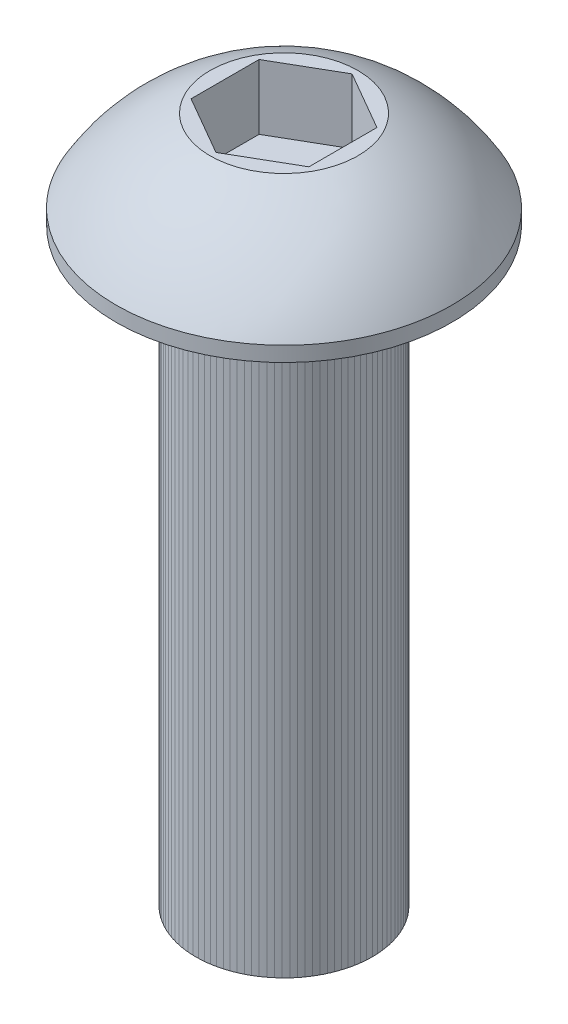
ISO-10303-21;
HEADER;
FILE_DESCRIPTION(('STEP AP214'),'2;1');
FILE_NAME('part.step','',(''),(''),'','','');
FILE_SCHEMA(('AUTOMOTIVE_DESIGN { 1 0 10303 214 1 1 1 1 }'));
ENDSEC;
DATA;
#1=APPLICATION_CONTEXT('core data for automotive mechanical design processes');
#2=APPLICATION_PROTOCOL_DEFINITION('international standard','automotive_design',2000,#1);
#3=PRODUCT_CONTEXT('',#1,'mechanical');
#4=PRODUCT('Part','Part','',(#3));
#5=PRODUCT_RELATED_PRODUCT_CATEGORY('part','',(#4));
#6=PRODUCT_DEFINITION_FORMATION('','',#4);
#7=PRODUCT_DEFINITION_CONTEXT('part definition',#1,'design');
#8=PRODUCT_DEFINITION('design','',#6,#7);
#9=PRODUCT_DEFINITION_SHAPE('','',#8);
#10=(LENGTH_UNIT() NAMED_UNIT(*) SI_UNIT(.MILLI.,.METRE.));
#11=(NAMED_UNIT(*) PLANE_ANGLE_UNIT() SI_UNIT($,.RADIAN.));
#12=(NAMED_UNIT(*) SI_UNIT($,.STERADIAN.) SOLID_ANGLE_UNIT());
#13=UNCERTAINTY_MEASURE_WITH_UNIT(LENGTH_MEASURE(1.E-05),#10,'distance_accuracy_value','');
#14=(GEOMETRIC_REPRESENTATION_CONTEXT(3) GLOBAL_UNCERTAINTY_ASSIGNED_CONTEXT((#13)) GLOBAL_UNIT_ASSIGNED_CONTEXT((#10,
#11,#12)) REPRESENTATION_CONTEXT('',''));
#15=CARTESIAN_POINT('',(0.,0.,0.));
#16=DIRECTION('',(0.,0.,1.));
#17=DIRECTION('',(1.,0.,0.));
#18=AXIS2_PLACEMENT_3D('',#15,#16,#17);
#19=CARTESIAN_POINT('',(0.,-10.,0.));
#20=DIRECTION('',(0.,1.,0.));
#21=DIRECTION('',(0.,0.,1.));
#22=AXIS2_PLACEMENT_3D('',#19,#20,#21);
#23=CYLINDRICAL_SURFACE('',#22,1.5);
#24=CARTESIAN_POINT('',(0.,0.,0.));
#25=DIRECTION('',(0.,1.,0.));
#26=DIRECTION('',(0.,0.,1.));
#27=AXIS2_PLACEMENT_3D('',#24,#25,#26);
#28=CIRCLE('',#27,1.5);
#29=CARTESIAN_POINT('',(0.,0.,1.5));
#30=VERTEX_POINT('',#29);
#31=EDGE_CURVE('P0_E16',#30,#30,#28,.F.);
#32=ORIENTED_EDGE('',*,*,#31,.T.);
#33=EDGE_LOOP('',(#32));
#34=FACE_BOUND('',#33,.T.);
#35=CARTESIAN_POINT('',(0.,-10.,0.));
#36=DIRECTION('',(0.,1.,0.));
#37=DIRECTION('',(0.,0.,1.));
#38=AXIS2_PLACEMENT_3D('',#35,#36,#37);
#39=CIRCLE('',#38,1.5);
#40=CARTESIAN_POINT('',(0.,-10.,1.5));
#41=VERTEX_POINT('',#40);
#42=EDGE_CURVE('P0_E10',#41,#41,#39,.T.);
#43=ORIENTED_EDGE('',*,*,#42,.T.);
#44=EDGE_LOOP('',(#43));
#45=FACE_BOUND('',#44,.T.);
#46=ADVANCED_FACE('P0_F15',(#34,#45),#23,.T.);
#47=OPEN_SHELL('',(#46));
#48=SHELL_BASED_SURFACE_MODEL('P0_B1',(#47));
#49=CARTESIAN_POINT('',(0.,0.55,0.));
#50=DIRECTION('',(0.,1.,0.));
#51=DIRECTION('',(0.,0.,1.));
#52=AXIS2_PLACEMENT_3D('',#49,#50,#51);
#53=PLANE('',#52);
#54=DIRECTION('',(0.866025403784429,0.,0.500000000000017));
#55=VECTOR('',#54,1.);
#56=CARTESIAN_POINT('',(-1.,0.55,0.5773502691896));
#57=LINE('',#56,#55);
#58=CARTESIAN_POINT('',(-1.,0.55,0.5773502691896));
#59=VERTEX_POINT('',#58);
#60=CARTESIAN_POINT('',(0.,0.55,1.15470053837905));
#61=VERTEX_POINT('',#60);
#62=EDGE_CURVE('P1_E92',#59,#61,#57,.T.);
#63=ORIENTED_EDGE('',*,*,#62,.T.);
#64=DIRECTION('',(0.866025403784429,0.,-0.500000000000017));
#65=VECTOR('',#64,1.);
#66=CARTESIAN_POINT('',(0.,0.55,1.154700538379));
#67=LINE('',#66,#65);
#68=CARTESIAN_POINT('',(0.999999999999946,0.55,0.577350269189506));
#69=VERTEX_POINT('',#68);
#70=EDGE_CURVE('P1_E89',#61,#69,#67,.T.);
#71=ORIENTED_EDGE('',*,*,#70,.T.);
#72=DIRECTION('',(0.,0.,-1.));
#73=VECTOR('',#72,1.);
#74=CARTESIAN_POINT('',(1.,0.55,0.5773502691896));
#75=LINE('',#74,#73);
#76=CARTESIAN_POINT('',(1.,0.55,-0.5773502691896));
#77=VERTEX_POINT('',#76);
#78=EDGE_CURVE('P1_E85',#69,#77,#75,.T.);
#79=ORIENTED_EDGE('',*,*,#78,.T.);
#80=DIRECTION('',(-0.866025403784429,0.,-0.500000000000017));
#81=VECTOR('',#80,1.);
#82=CARTESIAN_POINT('',(1.,0.55,-0.5773502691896));
#83=LINE('',#82,#81);
#84=CARTESIAN_POINT('',(0.,0.55,-1.15470053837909));
#85=VERTEX_POINT('',#84);
#86=EDGE_CURVE('P1_E115',#77,#85,#83,.T.);
#87=ORIENTED_EDGE('',*,*,#86,.T.);
#88=DIRECTION('',(-0.866025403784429,0.,0.500000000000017));
#89=VECTOR('',#88,1.);
#90=CARTESIAN_POINT('',(0.,0.55,-1.154700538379));
#91=LINE('',#90,#89);
#92=CARTESIAN_POINT('',(-0.999999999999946,0.55,-0.577350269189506));
#93=VERTEX_POINT('',#92);
#94=EDGE_CURVE('P1_E171',#85,#93,#91,.T.);
#95=ORIENTED_EDGE('',*,*,#94,.T.);
#96=DIRECTION('',(0.,0.,1.));
#97=VECTOR('',#96,1.);
#98=CARTESIAN_POINT('',(-1.,0.55,-0.5773502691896));
#99=LINE('',#98,#97);
#100=EDGE_CURVE('P1_E165',#93,#59,#99,.T.);
#101=ORIENTED_EDGE('',*,*,#100,.T.);
#102=EDGE_LOOP('',(#63,#71,#79,#87,#95,#101));
#103=FACE_BOUND('',#102,.T.);
#104=ADVANCED_FACE('P1_F17',(#103),#53,.T.);
#105=CARTESIAN_POINT('',(0.,1.65,1.154700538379));
#106=DIRECTION('',(0.500000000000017,0.,0.866025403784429));
#107=DIRECTION('',(0.866025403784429,0.,-0.500000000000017));
#108=AXIS2_PLACEMENT_3D('',#105,#106,#107);
#109=PLANE('',#108);
#110=ORIENTED_EDGE('',*,*,#70,.F.);
#111=DIRECTION('',(0.,1.,0.));
#112=VECTOR('',#111,1.);
#113=CARTESIAN_POINT('',(-1.08637057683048E-13,1.65,1.15470053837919));
#114=LINE('',#113,#112);
#115=CARTESIAN_POINT('',(0.,1.65,1.15470053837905));
#116=VERTEX_POINT('',#115);
#117=EDGE_CURVE('P1_E158',#61,#116,#114,.T.);
#118=ORIENTED_EDGE('',*,*,#117,.T.);
#119=DIRECTION('',(0.866025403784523,0.,-0.499999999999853));
#120=VECTOR('',#119,1.);
#121=CARTESIAN_POINT('',(0.,1.65,1.154700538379));
#122=LINE('',#121,#120);
#123=CARTESIAN_POINT('',(0.999999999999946,1.65,0.577350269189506));
#124=VERTEX_POINT('',#123);
#125=EDGE_CURVE('P1_E101',#116,#124,#122,.T.);
#126=ORIENTED_EDGE('',*,*,#125,.T.);
#127=DIRECTION('',(0.,1.,0.));
#128=VECTOR('',#127,1.);
#129=CARTESIAN_POINT('',(1.,1.65,0.5773502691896));
#130=LINE('',#129,#128);
#131=EDGE_CURVE('P1_E96',#124,#69,#130,.F.);
#132=ORIENTED_EDGE('',*,*,#131,.T.);
#133=EDGE_LOOP('',(#110,#118,#126,#132));
#134=FACE_BOUND('',#133,.T.);
#135=ADVANCED_FACE('P1_F99',(#134),#109,.F.);
#136=CARTESIAN_POINT('',(1.,1.65,0.5773502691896));
#137=DIRECTION('',(1.,0.,0.));
#138=DIRECTION('',(0.,0.,-1.));
#139=AXIS2_PLACEMENT_3D('',#136,#137,#138);
#140=PLANE('',#139);
#141=ORIENTED_EDGE('',*,*,#78,.F.);
#142=ORIENTED_EDGE('',*,*,#131,.F.);
#143=DIRECTION('',(0.,0.,-1.));
#144=VECTOR('',#143,1.);
#145=CARTESIAN_POINT('',(1.,1.65,0.));
#146=LINE('',#145,#144);
#147=CARTESIAN_POINT('',(1.,1.65,-0.5773502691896));
#148=VERTEX_POINT('',#147);
#149=EDGE_CURVE('P1_E154',#124,#148,#146,.T.);
#150=ORIENTED_EDGE('',*,*,#149,.T.);
#151=DIRECTION('',(0.,1.,0.));
#152=VECTOR('',#151,1.);
#153=CARTESIAN_POINT('',(1.,1.65,-0.5773502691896));
#154=LINE('',#153,#152);
#155=EDGE_CURVE('P1_E108',#148,#77,#154,.F.);
#156=ORIENTED_EDGE('',*,*,#155,.T.);
#157=EDGE_LOOP('',(#141,#142,#150,#156));
#158=FACE_BOUND('',#157,.T.);
#159=ADVANCED_FACE('P1_F106',(#158),#140,.F.);
#160=CARTESIAN_POINT('',(1.,1.65,-0.5773502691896));
#161=DIRECTION('',(0.500000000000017,0.,-0.866025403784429));
#162=DIRECTION('',(-0.866025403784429,0.,-0.500000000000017));
#163=AXIS2_PLACEMENT_3D('',#160,#161,#162);
#164=PLANE('',#163);
#165=ORIENTED_EDGE('',*,*,#86,.F.);
#166=ORIENTED_EDGE('',*,*,#155,.F.);
#167=DIRECTION('',(-0.866025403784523,0.,-0.499999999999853));
#168=VECTOR('',#167,1.);
#169=CARTESIAN_POINT('',(1.,1.65,-0.5773502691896));
#170=LINE('',#169,#168);
#171=CARTESIAN_POINT('',(0.,1.65,-1.15470053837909));
#172=VERTEX_POINT('',#171);
#173=EDGE_CURVE('P1_E151',#148,#172,#170,.T.);
#174=ORIENTED_EDGE('',*,*,#173,.T.);
#175=DIRECTION('',(0.,1.,0.));
#176=VECTOR('',#175,1.);
#177=CARTESIAN_POINT('',(0.,1.65,-1.154700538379));
#178=LINE('',#177,#176);
#179=EDGE_CURVE('P1_E174',#172,#85,#178,.F.);
#180=ORIENTED_EDGE('',*,*,#179,.T.);
#181=EDGE_LOOP('',(#165,#166,#174,#180));
#182=FACE_BOUND('',#181,.T.);
#183=ADVANCED_FACE('P1_F180',(#182),#164,.F.);
#184=CARTESIAN_POINT('',(0.,1.65,-1.154700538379));
#185=DIRECTION('',(-0.500000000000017,0.,-0.866025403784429));
#186=DIRECTION('',(-0.866025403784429,0.,0.500000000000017));
#187=AXIS2_PLACEMENT_3D('',#184,#185,#186);
#188=PLANE('',#187);
#189=ORIENTED_EDGE('',*,*,#94,.F.);
#190=ORIENTED_EDGE('',*,*,#179,.F.);
#191=DIRECTION('',(-0.866025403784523,0.,0.499999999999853));
#192=VECTOR('',#191,1.);
#193=CARTESIAN_POINT('',(0.,1.65,-1.154700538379));
#194=LINE('',#193,#192);
#195=CARTESIAN_POINT('',(-0.999999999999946,1.65,-0.577350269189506));
#196=VERTEX_POINT('',#195);
#197=EDGE_CURVE('P1_E144',#172,#196,#194,.T.);
#198=ORIENTED_EDGE('',*,*,#197,.T.);
#199=DIRECTION('',(0.,1.,0.));
#200=VECTOR('',#199,1.);
#201=CARTESIAN_POINT('',(-1.,1.65,-0.5773502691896));
#202=LINE('',#201,#200);
#203=EDGE_CURVE('P1_E167',#196,#93,#202,.F.);
#204=ORIENTED_EDGE('',*,*,#203,.T.);
#205=EDGE_LOOP('',(#189,#190,#198,#204));
#206=FACE_BOUND('',#205,.T.);
#207=ADVANCED_FACE('P1_F184',(#206),#188,.F.);
#208=CARTESIAN_POINT('',(-1.,1.65,-0.5773502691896));
#209=DIRECTION('',(-1.,0.,0.));
#210=DIRECTION('',(0.,0.,1.));
#211=AXIS2_PLACEMENT_3D('',#208,#209,#210);
#212=PLANE('',#211);
#213=ORIENTED_EDGE('',*,*,#100,.F.);
#214=ORIENTED_EDGE('',*,*,#203,.F.);
#215=DIRECTION('',(0.,0.,-1.));
#216=VECTOR('',#215,1.);
#217=CARTESIAN_POINT('',(-1.,1.65,0.));
#218=LINE('',#217,#216);
#219=CARTESIAN_POINT('',(-1.,1.65,0.5773502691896));
#220=VERTEX_POINT('',#219);
#221=EDGE_CURVE('P1_E44',#196,#220,#218,.F.);
#222=ORIENTED_EDGE('',*,*,#221,.T.);
#223=DIRECTION('',(0.,1.,0.));
#224=VECTOR('',#223,1.);
#225=CARTESIAN_POINT('',(-1.,1.65,0.5773502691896));
#226=LINE('',#225,#224);
#227=EDGE_CURVE('P1_E163',#220,#59,#226,.F.);
#228=ORIENTED_EDGE('',*,*,#227,.T.);
#229=EDGE_LOOP('',(#213,#214,#222,#228));
#230=FACE_BOUND('',#229,.T.);
#231=ADVANCED_FACE('P1_F186',(#230),#212,.F.);
#232=CARTESIAN_POINT('',(-1.,1.65,0.5773502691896));
#233=DIRECTION('',(-0.500000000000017,0.,0.866025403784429));
#234=DIRECTION('',(0.866025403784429,0.,0.500000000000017));
#235=AXIS2_PLACEMENT_3D('',#232,#233,#234);
#236=PLANE('',#235);
#237=ORIENTED_EDGE('',*,*,#62,.F.);
#238=ORIENTED_EDGE('',*,*,#227,.F.);
#239=DIRECTION('',(0.866025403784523,0.,0.499999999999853));
#240=VECTOR('',#239,1.);
#241=CARTESIAN_POINT('',(-1.,1.65,0.5773502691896));
#242=LINE('',#241,#240);
#243=EDGE_CURVE('P1_E133',#220,#116,#242,.T.);
#244=ORIENTED_EDGE('',*,*,#243,.T.);
#245=ORIENTED_EDGE('',*,*,#117,.F.);
#246=EDGE_LOOP('',(#237,#238,#244,#245));
#247=FACE_BOUND('',#246,.T.);
#248=ADVANCED_FACE('P1_F187',(#247),#236,.F.);
#249=CARTESIAN_POINT('',(0.,1.65,0.));
#250=DIRECTION('',(0.,-1.,0.));
#251=DIRECTION('',(0.,0.,-1.));
#252=AXIS2_PLACEMENT_3D('',#249,#250,#251);
#253=PLANE('',#252);
#254=ORIENTED_EDGE('',*,*,#221,.F.);
#255=ORIENTED_EDGE('',*,*,#197,.F.);
#256=ORIENTED_EDGE('',*,*,#173,.F.);
#257=ORIENTED_EDGE('',*,*,#149,.F.);
#258=ORIENTED_EDGE('',*,*,#125,.F.);
#259=ORIENTED_EDGE('',*,*,#243,.F.);
#260=EDGE_LOOP('',(#254,#255,#256,#257,#258,#259));
#261=FACE_BOUND('',#260,.T.);
#262=CARTESIAN_POINT('',(-1.25470053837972,1.65,0.));
#263=CARTESIAN_POINT('',(-1.2546965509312,1.64999999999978,-0.070424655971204));
#264=CARTESIAN_POINT('',(-1.24873864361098,1.64999999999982,-0.140974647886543));
#265=CARTESIAN_POINT('',(-1.23101016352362,1.65000000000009,-0.245237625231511));
#266=CARTESIAN_POINT('',(-1.22361994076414,1.65000000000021,-0.279775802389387));
#267=CARTESIAN_POINT('',(-1.20595086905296,1.64999999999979,-0.348140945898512));
#268=CARTESIAN_POINT('',(-1.19566967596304,1.64999999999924,-0.381967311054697));
#269=CARTESIAN_POINT('',(-1.16063107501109,1.64999999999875,-0.481845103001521));
#270=CARTESIAN_POINT('',(-1.13164986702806,1.64999999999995,-0.546463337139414));
#271=CARTESIAN_POINT('',(-1.0632361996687,1.65000000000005,-0.669911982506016));
#272=CARTESIAN_POINT('',(-1.02380334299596,1.64999999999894,-0.728742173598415));
#273=CARTESIAN_POINT('',(-0.957707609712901,1.64999999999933,-0.811368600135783));
#274=CARTESIAN_POINT('',(-0.934500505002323,1.6499999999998,-0.837989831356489));
#275=CARTESIAN_POINT('',(-0.885952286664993,1.6500000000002,-0.889159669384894));
#276=CARTESIAN_POINT('',(-0.86061325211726,1.65000000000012,-0.913710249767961));
#277=CARTESIAN_POINT('',(-0.78160082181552,1.64999999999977,-0.984041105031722));
#278=CARTESIAN_POINT('',(-0.724917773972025,1.6499999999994,-1.02651836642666));
#279=CARTESIAN_POINT('',(-0.605255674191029,1.64999999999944,-1.10132851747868));
#280=CARTESIAN_POINT('',(-0.542276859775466,1.64999999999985,-1.13366178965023));
#281=CARTESIAN_POINT('',(-0.411777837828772,1.65000000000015,-1.18730210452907));
#282=CARTESIAN_POINT('',(-0.344257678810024,1.65000000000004,-1.20860926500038));
#283=CARTESIAN_POINT('',(-0.206600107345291,1.64999999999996,-1.23958383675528));
#284=CARTESIAN_POINT('',(-0.136462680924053,1.64999999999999,-1.24925118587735));
#285=CARTESIAN_POINT('',(0.00443971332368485,1.65000000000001,-1.2566745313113));
#286=CARTESIAN_POINT('',(0.075204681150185,1.65,-1.25443052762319));
#287=CARTESIAN_POINT('',(0.21535490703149,1.65,-1.23809206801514));
#288=CARTESIAN_POINT('',(0.284740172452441,1.65,-1.22399767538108));
#289=CARTESIAN_POINT('',(0.42015312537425,1.65,-1.18436674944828));
#290=CARTESIAN_POINT('',(0.486180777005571,1.65,-1.1588300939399));
#291=CARTESIAN_POINT('',(0.613041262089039,1.65,-1.09700781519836));
#292=CARTESIAN_POINT('',(0.673873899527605,1.65,-1.06072178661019));
#293=CARTESIAN_POINT('',(0.759839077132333,1.65,-0.999082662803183));
#294=CARTESIAN_POINT('',(0.787617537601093,1.65,-0.977330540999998));
#295=CARTESIAN_POINT('',(0.8412737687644,1.65,-0.931545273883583));
#296=CARTESIAN_POINT('',(0.867149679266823,1.64999999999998,-0.907509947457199));
#297=CARTESIAN_POINT('',(0.941561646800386,1.65000000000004,-0.832286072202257));
#298=CARTESIAN_POINT('',(0.986957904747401,1.6500000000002,-0.7779250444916));
#299=CARTESIAN_POINT('',(1.06796444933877,1.6499999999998,-0.662348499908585));
#300=CARTESIAN_POINT('',(1.1035751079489,1.64999999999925,-0.601133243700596));
#301=CARTESIAN_POINT('',(1.1489145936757,1.64999999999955,-0.505490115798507));
#302=CARTESIAN_POINT('',(1.16269324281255,1.64999999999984,-0.472931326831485));
#303=CARTESIAN_POINT('',(1.18744810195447,1.65000000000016,-0.406801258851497));
#304=CARTESIAN_POINT('',(1.19842657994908,1.65000000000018,-0.373230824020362));
#305=CARTESIAN_POINT('',(1.22701255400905,1.64999999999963,-0.271407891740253));
#306=CARTESIAN_POINT('',(1.24035065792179,1.64999999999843,-0.201874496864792));
#307=CARTESIAN_POINT('',(1.25006989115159,1.64999999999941,-0.109940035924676));
#308=CARTESIAN_POINT('',(1.25180488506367,1.64999999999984,-0.0879909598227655));
#309=CARTESIAN_POINT('',(1.25412083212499,1.65000000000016,-0.0440320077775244));
#310=CARTESIAN_POINT('',(1.25470178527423,1.65000000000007,-0.0220221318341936));
#311=CARTESIAN_POINT('',(1.2546965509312,1.64999999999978,0.0704246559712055));
#312=CARTESIAN_POINT('',(1.24873864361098,1.64999999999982,0.140974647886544));
#313=CARTESIAN_POINT('',(1.23101016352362,1.65000000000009,0.245237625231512));
#314=CARTESIAN_POINT('',(1.22361994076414,1.65000000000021,0.279775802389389));
#315=CARTESIAN_POINT('',(1.20595086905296,1.64999999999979,0.348140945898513));
#316=CARTESIAN_POINT('',(1.19566967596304,1.64999999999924,0.381967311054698));
#317=CARTESIAN_POINT('',(1.16063107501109,1.64999999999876,0.481845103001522));
#318=CARTESIAN_POINT('',(1.13164986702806,1.64999999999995,0.546463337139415));
#319=CARTESIAN_POINT('',(1.0632361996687,1.65000000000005,0.669911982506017));
#320=CARTESIAN_POINT('',(1.02380334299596,1.64999999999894,0.728742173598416));
#321=CARTESIAN_POINT('',(0.9577076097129,1.64999999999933,0.811368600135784));
#322=CARTESIAN_POINT('',(0.934500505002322,1.6499999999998,0.83798983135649));
#323=CARTESIAN_POINT('',(0.885952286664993,1.6500000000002,0.889159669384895));
#324=CARTESIAN_POINT('',(0.860613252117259,1.65000000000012,0.913710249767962));
#325=CARTESIAN_POINT('',(0.781600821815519,1.64999999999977,0.984041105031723));
#326=CARTESIAN_POINT('',(0.724917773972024,1.6499999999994,1.02651836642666));
#327=CARTESIAN_POINT('',(0.605255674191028,1.64999999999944,1.10132851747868));
#328=CARTESIAN_POINT('',(0.542276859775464,1.64999999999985,1.13366178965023));
#329=CARTESIAN_POINT('',(0.411777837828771,1.65000000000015,1.18730210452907));
#330=CARTESIAN_POINT('',(0.344257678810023,1.65000000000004,1.20860926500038));
#331=CARTESIAN_POINT('',(0.20660010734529,1.64999999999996,1.23958383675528));
#332=CARTESIAN_POINT('',(0.136462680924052,1.64999999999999,1.24925118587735));
#333=CARTESIAN_POINT('',(-0.00443971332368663,1.65000000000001,1.2566745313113));
#334=CARTESIAN_POINT('',(-0.0752046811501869,1.65,1.25443052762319));
#335=CARTESIAN_POINT('',(-0.215354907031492,1.65,1.23809206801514));
#336=CARTESIAN_POINT('',(-0.284740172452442,1.65,1.22399767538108));
#337=CARTESIAN_POINT('',(-0.420153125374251,1.65,1.18436674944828));
#338=CARTESIAN_POINT('',(-0.486180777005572,1.65,1.1588300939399));
#339=CARTESIAN_POINT('',(-0.61304126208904,1.65,1.09700781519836));
#340=CARTESIAN_POINT('',(-0.673873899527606,1.65,1.06072178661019));
#341=CARTESIAN_POINT('',(-0.759839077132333,1.65,0.999082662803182));
#342=CARTESIAN_POINT('',(-0.787617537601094,1.65000000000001,0.977330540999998));
#343=CARTESIAN_POINT('',(-0.8412737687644,1.64999999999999,0.931545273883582));
#344=CARTESIAN_POINT('',(-0.867149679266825,1.64999999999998,0.907509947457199));
#345=CARTESIAN_POINT('',(-0.941561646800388,1.65000000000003,0.832286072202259));
#346=CARTESIAN_POINT('',(-0.986957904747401,1.6500000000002,0.7779250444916));
#347=CARTESIAN_POINT('',(-1.06796444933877,1.6499999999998,0.662348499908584));
#348=CARTESIAN_POINT('',(-1.10357510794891,1.64999999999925,0.601133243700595));
#349=CARTESIAN_POINT('',(-1.1489145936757,1.64999999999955,0.505490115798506));
#350=CARTESIAN_POINT('',(-1.16269324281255,1.64999999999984,0.472931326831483));
#351=CARTESIAN_POINT('',(-1.18744810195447,1.65000000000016,0.406801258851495));
#352=CARTESIAN_POINT('',(-1.19842657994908,1.65000000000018,0.373230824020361));
#353=CARTESIAN_POINT('',(-1.22701255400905,1.64999999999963,0.271407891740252));
#354=CARTESIAN_POINT('',(-1.24035065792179,1.64999999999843,0.20187449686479));
#355=CARTESIAN_POINT('',(-1.25006989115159,1.64999999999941,0.109940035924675));
#356=CARTESIAN_POINT('',(-1.25180488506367,1.64999999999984,0.0879909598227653));
#357=CARTESIAN_POINT('',(-1.25412083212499,1.65000000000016,0.0440320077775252));
#358=CARTESIAN_POINT('',(-1.25470178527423,1.65000000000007,0.0220221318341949));
#359=CARTESIAN_POINT('',(-1.25470053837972,1.65,0.));
#360=B_SPLINE_CURVE_WITH_KNOTS('',3,(#262,#263,#264,#265,#266,#267,#268,#269,#270,#271,#272,
#273,#274,#275,#276,#277,#278,#279,#280,#281,#282,#283,#284,#285,#286,#287,#288,#289,#290,#291,
#292,#293,#294,#295,#296,#297,#298,#299,#300,#301,#302,#303,#304,#305,#306,#307,#308,#309,#310,
#311,#312,#313,#314,#315,#316,#317,#318,#319,#320,#321,#322,#323,#324,#325,#326,#327,#328,#329,
#330,#331,#332,#333,#334,#335,#336,#337,#338,#339,#340,#341,#342,#343,#344,#345,#346,#347,#348,
#349,#350,#351,#352,#353,#354,#355,#356,#357,#358,#359),.UNSPECIFIED.,.T.,.F.,(4,2,2,2,2,2,2,2,
2,2,2,2,2,2,2,2,2,2,2,2,2,2,2,2,2,2,2,2,2,2,2,2,2,2,2,2,2,2,2,2,2,2,2,2,2,2,2,2,4),(0.,
0.211171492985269,0.317034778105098,0.422984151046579,0.634377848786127,0.84577958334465,
0.951618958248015,1.05735628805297,1.26876310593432,1.48016195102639,1.6915585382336,
1.90295625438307,2.1143539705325,2.32575055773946,2.53714940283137,2.74855622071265,
2.85429355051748,2.96013292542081,3.17153465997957,3.38292835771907,3.48887773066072,
3.59474101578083,3.80591250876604,3.87194685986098,3.93798121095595,4.14915270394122,
4.25501598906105,4.36096536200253,4.57235905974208,4.7837607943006,4.88960016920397,
4.99533749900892,5.20674431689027,5.41814316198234,5.62953974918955,5.84093746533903,
6.05233518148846,6.26373176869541,6.47513061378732,6.68653743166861,6.79227476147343,
6.89811413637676,7.10951587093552,7.32090956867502,7.42685894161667,7.53272222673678,
7.74389371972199,7.80992807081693,7.8759624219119),.UNSPECIFIED.);
#361=CARTESIAN_POINT('',(-1.25470053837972,1.65,0.));
#362=VERTEX_POINT('',#361);
#363=EDGE_CURVE('P1_E20',#362,#362,#360,.T.);
#364=ORIENTED_EDGE('',*,*,#363,.F.);
#365=EDGE_LOOP('',(#364));
#366=FACE_BOUND('',#365,.T.);
#367=ADVANCED_FACE('P1_F189',(#261,#366),#253,.F.);
#368=CARTESIAN_POINT('',(0.,-1.39317183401,0.));
#369=DIRECTION('',(-1.,0.,0.));
#370=DIRECTION('',(0.,0.,-1.));
#371=AXIS2_PLACEMENT_3D('',#368,#369,#370);
#372=SPHERICAL_SURFACE('',#371,3.291681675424);
#373=ORIENTED_EDGE('',*,*,#363,.T.);
#374=EDGE_LOOP('',(#373));
#375=FACE_BOUND('',#374,.T.);
#376=CARTESIAN_POINT('',(0.,0.2538461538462,0.));
#377=DIRECTION('',(0.,-1.,0.));
#378=DIRECTION('',(0.,0.,-1.));
#379=AXIS2_PLACEMENT_3D('',#376,#377,#378);
#380=CIRCLE('',#379,2.85);
#381=CARTESIAN_POINT('',(0.,0.2538461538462,-2.85));
#382=VERTEX_POINT('',#381);
#383=EDGE_CURVE('P1_E125',#382,#382,#380,.T.);
#384=ORIENTED_EDGE('',*,*,#383,.F.);
#385=EDGE_LOOP('',(#384));
#386=FACE_BOUND('',#385,.T.);
#387=ADVANCED_FACE('P1_F196',(#375,#386),#372,.T.);
#388=CARTESIAN_POINT('',(0.,1.993435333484,0.));
#389=DIRECTION('',(0.,-1.,0.));
#390=DIRECTION('',(0.,0.,-1.));
#391=AXIS2_PLACEMENT_3D('',#388,#389,#390);
#392=CYLINDRICAL_SURFACE('',#391,2.85);
#393=ORIENTED_EDGE('',*,*,#383,.T.);
#394=EDGE_LOOP('',(#393));
#395=FACE_BOUND('',#394,.T.);
#396=CARTESIAN_POINT('',(0.,0.,0.));
#397=DIRECTION('',(0.,-1.,0.));
#398=DIRECTION('',(0.,0.,-1.));
#399=AXIS2_PLACEMENT_3D('',#396,#397,#398);
#400=CIRCLE('',#399,2.85);
#401=CARTESIAN_POINT('',(0.,0.,-2.85));
#402=VERTEX_POINT('',#401);
#403=EDGE_CURVE('P1_E122',#402,#402,#400,.T.);
#404=ORIENTED_EDGE('',*,*,#403,.F.);
#405=EDGE_LOOP('',(#404));
#406=FACE_BOUND('',#405,.T.);
#407=ADVANCED_FACE('P1_F214',(#395,#406),#392,.T.);
#408=CARTESIAN_POINT('',(0.,-10.,0.));
#409=DIRECTION('',(0.,-1.,0.));
#410=DIRECTION('',(0.,0.,-1.));
#411=AXIS2_PLACEMENT_3D('',#408,#409,#410);
#412=PLANE('',#411);
#413=CARTESIAN_POINT('',(0.,-10.,0.));
#414=DIRECTION('',(0.,-1.,0.));
#415=DIRECTION('',(0.,0.,-1.));
#416=AXIS2_PLACEMENT_3D('',#413,#414,#415);
#417=CIRCLE('',#416,1.5);
#418=CARTESIAN_POINT('',(0.,-10.,-1.5));
#419=VERTEX_POINT('',#418);
#420=EDGE_CURVE('P1_E31',#419,#419,#417,.F.);
#421=ORIENTED_EDGE('',*,*,#420,.F.);
#422=EDGE_LOOP('',(#421));
#423=FACE_BOUND('',#422,.T.);
#424=ADVANCED_FACE('P1_F207',(#423),#412,.T.);
#425=CARTESIAN_POINT('',(0.,0.,0.));
#426=DIRECTION('',(0.,-1.,0.));
#427=DIRECTION('',(0.,0.,-1.));
#428=AXIS2_PLACEMENT_3D('',#425,#426,#427);
#429=PLANE('',#428);
#430=CARTESIAN_POINT('',(0.,0.,0.));
#431=DIRECTION('',(0.,-1.,0.));
#432=DIRECTION('',(0.,0.,-1.));
#433=AXIS2_PLACEMENT_3D('',#430,#431,#432);
#434=CIRCLE('',#433,1.5);
#435=CARTESIAN_POINT('',(0.,0.,-1.5));
#436=VERTEX_POINT('',#435);
#437=EDGE_CURVE('P1_E11',#436,#436,#434,.T.);
#438=ORIENTED_EDGE('',*,*,#437,.F.);
#439=EDGE_LOOP('',(#438));
#440=FACE_BOUND('',#439,.T.);
#441=ORIENTED_EDGE('',*,*,#403,.T.);
#442=EDGE_LOOP('',(#441));
#443=FACE_BOUND('',#442,.T.);
#444=ADVANCED_FACE('P1_F201',(#440,#443),#429,.T.);
#445=CARTESIAN_POINT('',(0.,0.,0.));
#446=DIRECTION('',(0.,-1.,0.));
#447=DIRECTION('',(0.,0.,-1.));
#448=AXIS2_PLACEMENT_3D('',#445,#446,#447);
#449=CYLINDRICAL_SURFACE('',#448,1.5);
#450=ORIENTED_EDGE('',*,*,#420,.T.);
#451=EDGE_LOOP('',(#450));
#452=FACE_BOUND('',#451,.T.);
#453=ORIENTED_EDGE('',*,*,#437,.T.);
#454=EDGE_LOOP('',(#453));
#455=FACE_BOUND('',#454,.T.);
#456=ADVANCED_FACE('P1_F199',(#452,#455),#449,.T.);
#457=CLOSED_SHELL('',(#104,#135,#159,#183,#207,#231,#248,#367,#387,#407,#424,#444,#456));
#458=MANIFOLD_SOLID_BREP('P1_B1',#457);
#459=ADVANCED_BREP_SHAPE_REPRESENTATION('',(#18,#458),#14);
#460=MANIFOLD_SURFACE_SHAPE_REPRESENTATION('',(#18,#48),#14);
#461=SHAPE_REPRESENTATION('',(#18),#14);
#462=SHAPE_DEFINITION_REPRESENTATION(#9,#461);
#463=SHAPE_REPRESENTATION_RELATIONSHIP('','',#461,#459);
#464=SHAPE_REPRESENTATION_RELATIONSHIP('','',#461,#460);
ENDSEC;
END-ISO-10303-21;
